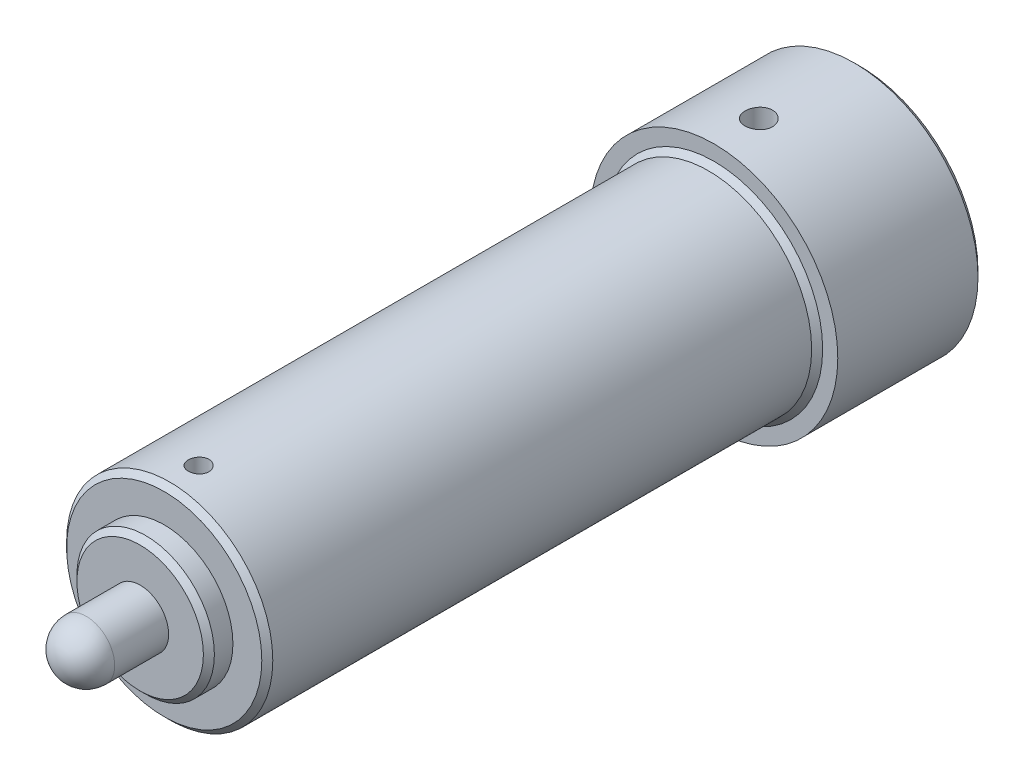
ISO-10303-21;
HEADER;
FILE_DESCRIPTION(('STEP AP214'),'2;1');
FILE_NAME('part.step','',(''),(''),'','','');
FILE_SCHEMA(('AUTOMOTIVE_DESIGN { 1 0 10303 214 1 1 1 1 }'));
ENDSEC;
DATA;
#1=APPLICATION_CONTEXT('core data for automotive mechanical design processes');
#2=APPLICATION_PROTOCOL_DEFINITION('international standard','automotive_design',2000,#1);
#3=PRODUCT_CONTEXT('',#1,'mechanical');
#4=PRODUCT('Part','Part','',(#3));
#5=PRODUCT_RELATED_PRODUCT_CATEGORY('part','',(#4));
#6=PRODUCT_DEFINITION_FORMATION('','',#4);
#7=PRODUCT_DEFINITION_CONTEXT('part definition',#1,'design');
#8=PRODUCT_DEFINITION('design','',#6,#7);
#9=PRODUCT_DEFINITION_SHAPE('','',#8);
#10=(LENGTH_UNIT() NAMED_UNIT(*) SI_UNIT(.MILLI.,.METRE.));
#11=(NAMED_UNIT(*) PLANE_ANGLE_UNIT() SI_UNIT($,.RADIAN.));
#12=(NAMED_UNIT(*) SI_UNIT($,.STERADIAN.) SOLID_ANGLE_UNIT());
#13=UNCERTAINTY_MEASURE_WITH_UNIT(LENGTH_MEASURE(1.E-05),#10,'distance_accuracy_value','');
#14=(GEOMETRIC_REPRESENTATION_CONTEXT(3) GLOBAL_UNCERTAINTY_ASSIGNED_CONTEXT((#13)) GLOBAL_UNIT_ASSIGNED_CONTEXT((#10,
#11,#12)) REPRESENTATION_CONTEXT('',''));
#15=CARTESIAN_POINT('',(0.,0.,0.));
#16=DIRECTION('',(0.,0.,1.));
#17=DIRECTION('',(1.,0.,0.));
#18=AXIS2_PLACEMENT_3D('',#15,#16,#17);
#19=CARTESIAN_POINT('',(0.,0.,21.2));
#20=DIRECTION('',(0.,0.,-1.));
#21=DIRECTION('',(-1.,0.,0.));
#22=AXIS2_PLACEMENT_3D('',#19,#20,#21);
#23=CYLINDRICAL_SURFACE('',#22,18.);
#24=CARTESIAN_POINT('',(0.,-18.,16.7));
#25=CARTESIAN_POINT('',(0.111970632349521,-17.9999985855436,16.6999951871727));
#26=CARTESIAN_POINT('',(0.224013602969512,-17.9989441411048,16.6905652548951));
#27=CARTESIAN_POINT('',(0.444988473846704,-17.9948391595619,16.6530924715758));
#28=CARTESIAN_POINT('',(0.553916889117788,-17.9917864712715,16.6250295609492));
#29=CARTESIAN_POINT('',(0.765431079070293,-17.9840293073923,16.5511220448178));
#30=CARTESIAN_POINT('',(0.868020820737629,-17.9793258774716,16.5052886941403));
#31=CARTESIAN_POINT('',(1.06403053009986,-17.9687919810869,16.3971643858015));
#32=CARTESIAN_POINT('',(1.1574522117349,-17.9629617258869,16.3348765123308));
#33=CARTESIAN_POINT('',(1.33290575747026,-17.9507977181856,16.1953179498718));
#34=CARTESIAN_POINT('',(1.4148915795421,-17.9444620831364,16.1179895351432));
#35=CARTESIAN_POINT('',(1.56475003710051,-17.9320167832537,15.9506685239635));
#36=CARTESIAN_POINT('',(1.63262199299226,-17.9259071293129,15.8606753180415));
#37=CARTESIAN_POINT('',(1.7524930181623,-17.9145866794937,15.6702860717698));
#38=CARTESIAN_POINT('',(1.80444975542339,-17.9093782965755,15.5698632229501));
#39=CARTESIAN_POINT('',(1.89074517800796,-17.9004741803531,15.3616505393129));
#40=CARTESIAN_POINT('',(1.92508439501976,-17.8967784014,15.253860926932));
#41=CARTESIAN_POINT('',(1.97503194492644,-17.8913354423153,15.0344480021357));
#42=CARTESIAN_POINT('',(1.99071729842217,-17.8895802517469,14.9228424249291));
#43=CARTESIAN_POINT('',(2.00315006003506,-17.8881925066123,14.6985701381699));
#44=CARTESIAN_POINT('',(1.99989807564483,-17.8885598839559,14.5859034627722));
#45=CARTESIAN_POINT('',(1.97461184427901,-17.891368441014,14.3632405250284));
#46=CARTESIAN_POINT('',(1.95266200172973,-17.8938003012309,14.2532345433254));
#47=CARTESIAN_POINT('',(1.89073461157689,-17.9004492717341,14.0384773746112));
#48=CARTESIAN_POINT('',(1.85075676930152,-17.904666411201,13.9337262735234));
#49=CARTESIAN_POINT('',(1.75381606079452,-17.9144214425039,13.7321875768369));
#50=CARTESIAN_POINT('',(1.6968160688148,-17.9199622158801,13.6354179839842));
#51=CARTESIAN_POINT('',(1.56747570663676,-17.9317378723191,13.4527863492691));
#52=CARTESIAN_POINT('',(1.49513478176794,-17.9379727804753,13.3669247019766));
#53=CARTESIAN_POINT('',(1.33669614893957,-17.9504756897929,13.2080560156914));
#54=CARTESIAN_POINT('',(1.25052560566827,-17.9567436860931,13.1351215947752));
#55=CARTESIAN_POINT('',(1.06712581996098,-17.9685745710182,13.0047416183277));
#56=CARTESIAN_POINT('',(0.969896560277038,-17.9741374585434,12.9472960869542));
#57=CARTESIAN_POINT('',(0.767086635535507,-17.9839338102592,12.8495262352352));
#58=CARTESIAN_POINT('',(0.661504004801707,-17.9881669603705,12.8092059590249));
#59=CARTESIAN_POINT('',(0.445009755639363,-17.9948238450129,12.7468862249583));
#60=CARTESIAN_POINT('',(0.33409833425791,-17.997247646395,12.7248860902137));
#61=CARTESIAN_POINT('',(0.110723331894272,-18.0000041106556,12.6999240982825));
#62=CARTESIAN_POINT('',(-0.00172892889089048,-18.0003477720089,12.6968621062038));
#63=CARTESIAN_POINT('',(-0.225544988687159,-17.998934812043,12.7095997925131));
#64=CARTESIAN_POINT('',(-0.336908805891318,-17.9971782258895,12.7253991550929));
#65=CARTESIAN_POINT('',(-0.555095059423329,-17.9917690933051,12.7753279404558));
#66=CARTESIAN_POINT('',(-0.661928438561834,-17.9881214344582,12.8094101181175));
#67=CARTESIAN_POINT('',(-0.868362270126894,-17.9793390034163,12.8948882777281));
#68=CARTESIAN_POINT('',(-0.967962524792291,-17.9742041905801,12.946284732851));
#69=CARTESIAN_POINT('',(-1.15755326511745,-17.9629935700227,13.065178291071));
#70=CARTESIAN_POINT('',(-1.24750253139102,-17.9569139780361,13.1327407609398));
#71=CARTESIAN_POINT('',(-1.41481983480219,-17.9445071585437,13.2819552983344));
#72=CARTESIAN_POINT('',(-1.49218748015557,-17.938179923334,13.3636078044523));
#73=CARTESIAN_POINT('',(-1.63249622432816,-17.925957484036,13.539123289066));
#74=CARTESIAN_POINT('',(-1.69537132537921,-17.920064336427,13.6330391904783));
#75=CARTESIAN_POINT('',(-1.80445556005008,-17.9094097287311,13.8301562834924));
#76=CARTESIAN_POINT('',(-1.85066496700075,-17.9046482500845,13.9333573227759));
#77=CARTESIAN_POINT('',(-1.92499712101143,-17.8968094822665,14.1458944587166));
#78=CARTESIAN_POINT('',(-1.95315827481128,-17.8937286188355,14.2552169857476));
#79=CARTESIAN_POINT('',(-1.99071877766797,-17.8895891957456,14.4770751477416));
#80=CARTESIAN_POINT('',(-2.00011880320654,-17.8885305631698,14.5896106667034));
#81=CARTESIAN_POINT('',(-1.99987957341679,-17.8885572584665,14.814044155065));
#82=CARTESIAN_POINT('',(-1.99034399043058,-17.8896309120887,14.9259422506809));
#83=CARTESIAN_POINT('',(-1.9527225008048,-17.8937762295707,15.1465357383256));
#84=CARTESIAN_POINT('',(-1.92463658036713,-17.8968478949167,15.2552311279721));
#85=CARTESIAN_POINT('',(-1.85074191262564,-17.9046397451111,15.4663275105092));
#86=CARTESIAN_POINT('',(-1.80493703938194,-17.9093595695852,15.5687298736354));
#87=CARTESIAN_POINT('',(-1.69691508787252,-17.9199166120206,15.7644104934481));
#88=CARTESIAN_POINT('',(-1.63469797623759,-17.9257538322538,15.857688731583));
#89=CARTESIAN_POINT('',(-1.49522995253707,-17.9379262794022,16.0330042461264));
#90=CARTESIAN_POINT('',(-1.41790170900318,-17.944263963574,16.1149798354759));
#91=CARTESIAN_POINT('',(-1.25056419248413,-17.9567010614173,16.2648338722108));
#92=CARTESIAN_POINT('',(-1.16055190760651,-17.962800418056,16.3327089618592));
#93=CARTESIAN_POINT('',(-0.970094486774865,-17.9740935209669,16.4526043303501));
#94=CARTESIAN_POINT('',(-0.869618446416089,-17.9792844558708,16.5045757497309));
#95=CARTESIAN_POINT('',(-0.661368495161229,-17.9881463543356,16.5908374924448));
#96=CARTESIAN_POINT('',(-0.553602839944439,-17.9918190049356,16.6251474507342));
#97=CARTESIAN_POINT('',(-0.371040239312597,-17.9963232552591,16.6666991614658));
#98=CARTESIAN_POINT('',(-0.297404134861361,-17.9976954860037,16.6791695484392));
#99=CARTESIAN_POINT('',(-0.149189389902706,-17.9995343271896,16.695821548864));
#100=CARTESIAN_POINT('',(-0.0746107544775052,-18.000000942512,16.7000032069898));
#101=CARTESIAN_POINT('',(0.,-18.,16.7));
#102=B_SPLINE_CURVE_WITH_KNOTS('',3,(#24,#25,#26,#27,#28,#29,#30,#31,#32,#33,#34,#35,#36,#37,
#38,#39,#40,#41,#42,#43,#44,#45,#46,#47,#48,#49,#50,#51,#52,#53,#54,#55,#56,#57,#58,#59,#60,#61,
#62,#63,#64,#65,#66,#67,#68,#69,#70,#71,#72,#73,#74,#75,#76,#77,#78,#79,#80,#81,#82,#83,#84,#85,
#86,#87,#88,#89,#90,#91,#92,#93,#94,#95,#96,#97,#98,#99,#100,#101),.UNSPECIFIED.,.T.,.F.,(4,2,2,
2,2,2,2,2,2,2,2,2,2,2,2,2,2,2,2,2,2,2,2,2,2,2,2,2,2,2,2,2,2,2,2,2,2,2,4),(0.,0.335639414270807,
0.671640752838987,1.00742963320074,1.34315561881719,1.68019649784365,2.01725360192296,
2.35519959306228,2.69313538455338,3.02967096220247,3.36619574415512,3.70120941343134,
4.03622855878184,4.37198379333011,4.70775116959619,5.0453487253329,5.3829468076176,
5.72062456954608,6.05828985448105,6.39416820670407,6.73004093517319,7.06504987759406,
7.40006797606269,7.73646430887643,8.07287111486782,8.41078088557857,8.74868511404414,
9.08586787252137,9.42303847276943,9.75836815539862,10.0936980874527,10.4289547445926,
10.7642120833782,11.1012322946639,11.4383326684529,11.7764585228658,12.1142076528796,
12.3378595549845,12.5615102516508),.UNSPECIFIED.);
#103=CARTESIAN_POINT('',(0.,-18.,16.7));
#104=VERTEX_POINT('',#103);
#105=EDGE_CURVE('E10',#104,#104,#102,.T.);
#106=ORIENTED_EDGE('',*,*,#105,.T.);
#107=EDGE_LOOP('',(#106));
#108=FACE_BOUND('',#107,.T.);
#109=CARTESIAN_POINT('',(0.,18.,16.7));
#110=CARTESIAN_POINT('',(-0.111970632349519,17.9999985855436,16.6999951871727));
#111=CARTESIAN_POINT('',(-0.22401360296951,17.9989441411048,16.6905652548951));
#112=CARTESIAN_POINT('',(-0.444988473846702,17.9948391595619,16.6530924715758));
#113=CARTESIAN_POINT('',(-0.553916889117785,17.9917864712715,16.6250295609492));
#114=CARTESIAN_POINT('',(-0.765431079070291,17.9840293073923,16.5511220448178));
#115=CARTESIAN_POINT('',(-0.868020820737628,17.9793258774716,16.5052886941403));
#116=CARTESIAN_POINT('',(-1.06403053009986,17.9687919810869,16.3971643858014));
#117=CARTESIAN_POINT('',(-1.15745221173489,17.9629617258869,16.3348765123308));
#118=CARTESIAN_POINT('',(-1.33290575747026,17.9507977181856,16.1953179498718));
#119=CARTESIAN_POINT('',(-1.4148915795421,17.9444620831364,16.1179895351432));
#120=CARTESIAN_POINT('',(-1.56475003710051,17.9320167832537,15.9506685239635));
#121=CARTESIAN_POINT('',(-1.63262199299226,17.9259071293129,15.8606753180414));
#122=CARTESIAN_POINT('',(-1.7524930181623,17.9145866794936,15.6702860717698));
#123=CARTESIAN_POINT('',(-1.80444975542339,17.9093782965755,15.5698632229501));
#124=CARTESIAN_POINT('',(-1.89074517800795,17.9004741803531,15.3616505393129));
#125=CARTESIAN_POINT('',(-1.92508439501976,17.8967784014,15.253860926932));
#126=CARTESIAN_POINT('',(-1.97503194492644,17.8913354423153,15.0344480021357));
#127=CARTESIAN_POINT('',(-1.99071729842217,17.8895802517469,14.9228424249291));
#128=CARTESIAN_POINT('',(-2.00315006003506,17.8881925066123,14.6985701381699));
#129=CARTESIAN_POINT('',(-1.99989807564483,17.8885598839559,14.5859034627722));
#130=CARTESIAN_POINT('',(-1.97461184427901,17.891368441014,14.3632405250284));
#131=CARTESIAN_POINT('',(-1.95266200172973,17.8938003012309,14.2532345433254));
#132=CARTESIAN_POINT('',(-1.89073461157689,17.9004492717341,14.0384773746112));
#133=CARTESIAN_POINT('',(-1.85075676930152,17.904666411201,13.9337262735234));
#134=CARTESIAN_POINT('',(-1.75381606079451,17.9144214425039,13.7321875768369));
#135=CARTESIAN_POINT('',(-1.6968160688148,17.9199622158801,13.6354179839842));
#136=CARTESIAN_POINT('',(-1.56747570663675,17.9317378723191,13.4527863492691));
#137=CARTESIAN_POINT('',(-1.49513478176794,17.9379727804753,13.3669247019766));
#138=CARTESIAN_POINT('',(-1.33669614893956,17.9504756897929,13.2080560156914));
#139=CARTESIAN_POINT('',(-1.25052560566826,17.9567436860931,13.1351215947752));
#140=CARTESIAN_POINT('',(-1.06712581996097,17.9685745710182,13.0047416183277));
#141=CARTESIAN_POINT('',(-0.969896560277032,17.9741374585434,12.9472960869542));
#142=CARTESIAN_POINT('',(-0.767086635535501,17.9839338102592,12.8495262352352));
#143=CARTESIAN_POINT('',(-0.661504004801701,17.9881669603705,12.8092059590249));
#144=CARTESIAN_POINT('',(-0.445009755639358,17.9948238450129,12.7468862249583));
#145=CARTESIAN_POINT('',(-0.334098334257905,17.997247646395,12.7248860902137));
#146=CARTESIAN_POINT('',(-0.110723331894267,18.0000041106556,12.6999240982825));
#147=CARTESIAN_POINT('',(0.00172892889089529,18.0003477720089,12.6968621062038));
#148=CARTESIAN_POINT('',(0.225544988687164,17.998934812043,12.7095997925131));
#149=CARTESIAN_POINT('',(0.336908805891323,17.9971782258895,12.7253991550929));
#150=CARTESIAN_POINT('',(0.555095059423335,17.9917690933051,12.7753279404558));
#151=CARTESIAN_POINT('',(0.661928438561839,17.9881214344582,12.8094101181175));
#152=CARTESIAN_POINT('',(0.868362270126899,17.9793390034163,12.8948882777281));
#153=CARTESIAN_POINT('',(0.967962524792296,17.9742041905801,12.946284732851));
#154=CARTESIAN_POINT('',(1.15755326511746,17.9629935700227,13.065178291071));
#155=CARTESIAN_POINT('',(1.24750253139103,17.9569139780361,13.1327407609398));
#156=CARTESIAN_POINT('',(1.4148198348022,17.9445071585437,13.2819552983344));
#157=CARTESIAN_POINT('',(1.49218748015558,17.938179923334,13.3636078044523));
#158=CARTESIAN_POINT('',(1.63249622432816,17.925957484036,13.539123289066));
#159=CARTESIAN_POINT('',(1.69537132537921,17.920064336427,13.6330391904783));
#160=CARTESIAN_POINT('',(1.80445556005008,17.9094097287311,13.8301562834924));
#161=CARTESIAN_POINT('',(1.85066496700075,17.9046482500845,13.9333573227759));
#162=CARTESIAN_POINT('',(1.92499712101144,17.8968094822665,14.1458944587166));
#163=CARTESIAN_POINT('',(1.95315827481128,17.8937286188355,14.2552169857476));
#164=CARTESIAN_POINT('',(1.99071877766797,17.8895891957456,14.4770751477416));
#165=CARTESIAN_POINT('',(2.00011880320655,17.8885305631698,14.5896106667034));
#166=CARTESIAN_POINT('',(1.99987957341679,17.8885572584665,14.814044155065));
#167=CARTESIAN_POINT('',(1.99034399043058,17.8896309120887,14.9259422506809));
#168=CARTESIAN_POINT('',(1.9527225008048,17.8937762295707,15.1465357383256));
#169=CARTESIAN_POINT('',(1.92463658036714,17.8968478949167,15.2552311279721));
#170=CARTESIAN_POINT('',(1.85074191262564,17.9046397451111,15.4663275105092));
#171=CARTESIAN_POINT('',(1.80493703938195,17.9093595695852,15.5687298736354));
#172=CARTESIAN_POINT('',(1.69691508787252,17.9199166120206,15.7644104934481));
#173=CARTESIAN_POINT('',(1.6346979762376,17.9257538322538,15.857688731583));
#174=CARTESIAN_POINT('',(1.49522995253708,17.9379262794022,16.0330042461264));
#175=CARTESIAN_POINT('',(1.41790170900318,17.944263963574,16.1149798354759));
#176=CARTESIAN_POINT('',(1.25056419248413,17.9567010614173,16.2648338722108));
#177=CARTESIAN_POINT('',(1.16055190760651,17.962800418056,16.3327089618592));
#178=CARTESIAN_POINT('',(0.970094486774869,17.9740935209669,16.4526043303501));
#179=CARTESIAN_POINT('',(0.869618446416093,17.9792844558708,16.5045757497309));
#180=CARTESIAN_POINT('',(0.661368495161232,17.9881463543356,16.5908374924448));
#181=CARTESIAN_POINT('',(0.553602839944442,17.9918190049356,16.6251474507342));
#182=CARTESIAN_POINT('',(0.371040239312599,17.9963232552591,16.6666991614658));
#183=CARTESIAN_POINT('',(0.297404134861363,17.9976954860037,16.6791695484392));
#184=CARTESIAN_POINT('',(0.149189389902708,17.9995343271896,16.695821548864));
#185=CARTESIAN_POINT('',(0.0746107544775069,18.000000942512,16.7000032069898));
#186=CARTESIAN_POINT('',(0.,18.,16.7));
#187=B_SPLINE_CURVE_WITH_KNOTS('',3,(#109,#110,#111,#112,#113,#114,#115,#116,#117,#118,#119,
#120,#121,#122,#123,#124,#125,#126,#127,#128,#129,#130,#131,#132,#133,#134,#135,#136,#137,#138,
#139,#140,#141,#142,#143,#144,#145,#146,#147,#148,#149,#150,#151,#152,#153,#154,#155,#156,#157,
#158,#159,#160,#161,#162,#163,#164,#165,#166,#167,#168,#169,#170,#171,#172,#173,#174,#175,#176,
#177,#178,#179,#180,#181,#182,#183,#184,#185,#186),.UNSPECIFIED.,.T.,.F.,(4,2,2,2,2,2,2,2,2,2,2,
2,2,2,2,2,2,2,2,2,2,2,2,2,2,2,2,2,2,2,2,2,2,2,2,2,2,2,4),(0.,0.335639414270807,
0.671640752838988,1.00742963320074,1.34315561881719,1.68019649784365,2.01725360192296,
2.35519959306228,2.69313538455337,3.02967096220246,3.36619574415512,3.70120941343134,
4.03622855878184,4.37198379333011,4.70775116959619,5.0453487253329,5.3829468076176,
5.72062456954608,6.05828985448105,6.39416820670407,6.73004093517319,7.06504987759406,
7.40006797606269,7.73646430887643,8.07287111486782,8.41078088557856,8.74868511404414,
9.08586787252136,9.42303847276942,9.75836815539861,10.0936980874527,10.4289547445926,
10.7642120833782,11.1012322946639,11.4383326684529,11.7764585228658,12.1142076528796,
12.3378595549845,12.5615102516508),.UNSPECIFIED.);
#188=CARTESIAN_POINT('',(0.,18.,16.7));
#189=VERTEX_POINT('',#188);
#190=EDGE_CURVE('E55',#189,#189,#187,.T.);
#191=ORIENTED_EDGE('',*,*,#190,.T.);
#192=EDGE_LOOP('',(#191));
#193=FACE_BOUND('',#192,.T.);
#194=CARTESIAN_POINT('',(0.,0.,0.799999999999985));
#195=DIRECTION('',(0.,0.,1.));
#196=DIRECTION('',(1.,0.,0.));
#197=AXIS2_PLACEMENT_3D('',#194,#195,#196);
#198=CIRCLE('',#197,18.);
#199=CARTESIAN_POINT('',(18.,0.,0.799999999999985));
#200=VERTEX_POINT('',#199);
#201=EDGE_CURVE('E135',#200,#200,#198,.T.);
#202=ORIENTED_EDGE('',*,*,#201,.T.);
#203=EDGE_LOOP('',(#202));
#204=FACE_BOUND('',#203,.T.);
#205=CARTESIAN_POINT('',(0.,0.,21.2));
#206=DIRECTION('',(0.,0.,1.));
#207=DIRECTION('',(1.,0.,0.));
#208=AXIS2_PLACEMENT_3D('',#205,#206,#207);
#209=CIRCLE('',#208,18.);
#210=CARTESIAN_POINT('',(18.,0.,21.2));
#211=VERTEX_POINT('',#210);
#212=EDGE_CURVE('E104',#211,#211,#209,.T.);
#213=ORIENTED_EDGE('',*,*,#212,.F.);
#214=EDGE_LOOP('',(#213));
#215=FACE_BOUND('',#214,.T.);
#216=ADVANCED_FACE('F45',(#108,#193,#204,#215),#23,.T.);
#217=CARTESIAN_POINT('',(0.,0.,21.2));
#218=DIRECTION('',(0.,0.,1.));
#219=DIRECTION('',(1.,0.,0.));
#220=AXIS2_PLACEMENT_3D('',#217,#218,#219);
#221=PLANE('',#220);
#222=CARTESIAN_POINT('',(0.,0.,21.2));
#223=DIRECTION('',(0.,0.,1.));
#224=DIRECTION('',(1.,0.,0.));
#225=AXIS2_PLACEMENT_3D('',#222,#223,#224);
#226=CIRCLE('',#225,15.8);
#227=CARTESIAN_POINT('',(15.8,0.,21.2));
#228=VERTEX_POINT('',#227);
#229=EDGE_CURVE('E166',#228,#228,#226,.F.);
#230=ORIENTED_EDGE('',*,*,#229,.T.);
#231=EDGE_LOOP('',(#230));
#232=FACE_BOUND('',#231,.T.);
#233=ORIENTED_EDGE('',*,*,#212,.T.);
#234=EDGE_LOOP('',(#233));
#235=FACE_BOUND('',#234,.T.);
#236=ADVANCED_FACE('F114',(#232,#235),#221,.T.);
#237=CARTESIAN_POINT('',(0.,0.,0.));
#238=DIRECTION('',(0.,0.,1.));
#239=DIRECTION('',(1.,0.,0.));
#240=AXIS2_PLACEMENT_3D('',#237,#238,#239);
#241=PLANE('',#240);
#242=CARTESIAN_POINT('',(0.,0.,0.));
#243=DIRECTION('',(0.,0.,1.));
#244=DIRECTION('',(1.,0.,0.));
#245=AXIS2_PLACEMENT_3D('',#242,#243,#244);
#246=CIRCLE('',#245,15.5);
#247=CARTESIAN_POINT('',(15.5,0.,0.));
#248=VERTEX_POINT('',#247);
#249=EDGE_CURVE('E50',#248,#248,#246,.F.);
#250=ORIENTED_EDGE('',*,*,#249,.F.);
#251=EDGE_LOOP('',(#250));
#252=FACE_BOUND('',#251,.T.);
#253=CARTESIAN_POINT('',(0.,0.,0.));
#254=DIRECTION('',(0.,0.,1.));
#255=DIRECTION('',(1.,0.,0.));
#256=AXIS2_PLACEMENT_3D('',#253,#254,#255);
#257=CIRCLE('',#256,17.2);
#258=CARTESIAN_POINT('',(17.2,0.,0.));
#259=VERTEX_POINT('',#258);
#260=EDGE_CURVE('E154',#259,#259,#257,.F.);
#261=ORIENTED_EDGE('',*,*,#260,.T.);
#262=EDGE_LOOP('',(#261));
#263=FACE_BOUND('',#262,.T.);
#264=ADVANCED_FACE('F111',(#252,#263),#241,.F.);
#265=CARTESIAN_POINT('',(0.,0.,101.2));
#266=DIRECTION('',(0.,0.,-1.));
#267=DIRECTION('',(-1.,0.,0.));
#268=AXIS2_PLACEMENT_3D('',#265,#266,#267);
#269=CYLINDRICAL_SURFACE('',#268,15.);
#270=CARTESIAN_POINT('',(0.,-15.,97.7));
#271=CARTESIAN_POINT('',(0.084030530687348,-14.9999990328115,97.6999963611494));
#272=CARTESIAN_POINT('',(0.168116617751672,-14.9992863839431,97.6929150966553));
#273=CARTESIAN_POINT('',(0.333957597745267,-14.9965120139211,97.6647734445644));
#274=CARTESIAN_POINT('',(0.415709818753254,-14.9944488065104,97.6436976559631));
#275=CARTESIAN_POINT('',(0.574457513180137,-14.9892062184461,97.5881866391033));
#276=CARTESIAN_POINT('',(0.651455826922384,-14.9860275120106,97.5537594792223));
#277=CARTESIAN_POINT('',(0.79856424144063,-14.9789093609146,97.4725386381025));
#278=CARTESIAN_POINT('',(0.868675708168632,-14.974970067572,97.4257474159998));
#279=CARTESIAN_POINT('',(1.00028932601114,-14.9667561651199,97.3209459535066));
#280=CARTESIAN_POINT('',(1.06176321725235,-14.962480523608,97.2629003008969));
#281=CARTESIAN_POINT('',(1.17411378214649,-14.9540843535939,97.1373131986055));
#282=CARTESIAN_POINT('',(1.22498996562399,-14.9499638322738,97.0697713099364));
#283=CARTESIAN_POINT('',(1.31480095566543,-14.9423338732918,96.9269322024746));
#284=CARTESIAN_POINT('',(1.35371019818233,-14.9388257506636,96.8516188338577));
#285=CARTESIAN_POINT('',(1.41831957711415,-14.9328305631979,96.6954866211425));
#286=CARTESIAN_POINT('',(1.44402003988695,-14.9303434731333,96.6146679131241));
#287=CARTESIAN_POINT('',(1.48139856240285,-14.9266812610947,96.450107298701));
#288=CARTESIAN_POINT('',(1.49312347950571,-14.9255017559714,96.3663761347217));
#289=CARTESIAN_POINT('',(1.50236292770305,-14.9245746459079,96.1981267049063));
#290=CARTESIAN_POINT('',(1.49987783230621,-14.9248270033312,96.1136084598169));
#291=CARTESIAN_POINT('',(1.48080642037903,-14.926731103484,95.94650703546));
#292=CARTESIAN_POINT('',(1.46427126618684,-14.9283777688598,95.8639179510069));
#293=CARTESIAN_POINT('',(1.41764871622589,-14.9328770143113,95.7026930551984));
#294=CARTESIAN_POINT('',(1.38756113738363,-14.9357296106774,95.6240572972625));
#295=CARTESIAN_POINT('',(1.31463134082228,-14.942325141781,95.4728096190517));
#296=CARTESIAN_POINT('',(1.27176642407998,-14.9460696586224,95.400208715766));
#297=CARTESIAN_POINT('',(1.17451504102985,-14.9540257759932,95.2632121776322));
#298=CARTESIAN_POINT('',(1.12012823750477,-14.9582373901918,95.1988167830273));
#299=CARTESIAN_POINT('',(1.00109116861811,-14.9666757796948,95.0797619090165));
#300=CARTESIAN_POINT('',(0.936396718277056,-14.970902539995,95.0251465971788));
#301=CARTESIAN_POINT('',(0.798734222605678,-14.9788774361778,94.9275445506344));
#302=CARTESIAN_POINT('',(0.725766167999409,-14.9826255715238,94.8845578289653));
#303=CARTESIAN_POINT('',(0.573597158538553,-14.9892221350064,94.8114349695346));
#304=CARTESIAN_POINT('',(0.494395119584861,-14.9920704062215,94.7813010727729));
#305=CARTESIAN_POINT('',(0.332020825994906,-14.9965447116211,94.7347716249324));
#306=CARTESIAN_POINT('',(0.24884869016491,-14.9981707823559,94.7183756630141));
#307=CARTESIAN_POINT('',(0.081277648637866,-15.0000127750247,94.6998435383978));
#308=CARTESIAN_POINT('',(-0.00311445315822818,-15.000234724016,94.6976464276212));
#309=CARTESIAN_POINT('',(-0.17106568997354,-14.999259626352,94.7074142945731));
#310=CARTESIAN_POINT('',(-0.254624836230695,-14.998062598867,94.7193790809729));
#311=CARTESIAN_POINT('',(-0.418362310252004,-14.9943879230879,94.7570805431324));
#312=CARTESIAN_POINT('',(-0.498547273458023,-14.9919129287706,94.782788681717));
#313=CARTESIAN_POINT('',(-0.653466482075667,-14.9859599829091,94.8472177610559));
#314=CARTESIAN_POINT('',(-0.728200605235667,-14.9824820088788,94.8859389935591));
#315=CARTESIAN_POINT('',(-0.870372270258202,-14.9748971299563,94.9754462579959));
#316=CARTESIAN_POINT('',(-0.937784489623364,-14.9707881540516,95.0262723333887));
#317=CARTESIAN_POINT('',(-1.06314243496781,-14.9624089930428,95.1384891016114));
#318=CARTESIAN_POINT('',(-1.12108792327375,-14.9581388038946,95.1998800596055));
#319=CARTESIAN_POINT('',(-1.22607916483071,-14.9499003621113,95.3317498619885));
#320=CARTESIAN_POINT('',(-1.27308491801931,-14.9459332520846,95.4022606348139));
#321=CARTESIAN_POINT('',(-1.35458738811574,-14.9387674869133,95.55021104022));
#322=CARTESIAN_POINT('',(-1.38908427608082,-14.9355688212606,95.6276505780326));
#323=CARTESIAN_POINT('',(-1.4445228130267,-14.9303092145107,95.7871231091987));
#324=CARTESIAN_POINT('',(-1.46548826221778,-14.9282462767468,95.8691477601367));
#325=CARTESIAN_POINT('',(-1.49334601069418,-14.9254854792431,96.0355747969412));
#326=CARTESIAN_POINT('',(-1.50023871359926,-14.9247875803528,96.1199771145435));
#327=CARTESIAN_POINT('',(-1.49974970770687,-14.9248366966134,96.288366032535));
#328=CARTESIAN_POINT('',(-1.49243083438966,-14.9255773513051,96.3723528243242));
#329=CARTESIAN_POINT('',(-1.46385817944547,-14.9284065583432,96.5378973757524));
#330=CARTESIAN_POINT('',(-1.44260438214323,-14.9304951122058,96.619455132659));
#331=CARTESIAN_POINT('',(-1.38678252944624,-14.9357830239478,96.7778260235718));
#332=CARTESIAN_POINT('',(-1.35221631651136,-14.9389822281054,96.8546398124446));
#333=CARTESIAN_POINT('',(-1.27075733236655,-14.9461312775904,97.0013853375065));
#334=CARTESIAN_POINT('',(-1.22386463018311,-14.9500811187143,97.0713171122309));
#335=CARTESIAN_POINT('',(-1.11884783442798,-14.9583073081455,97.2026355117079));
#336=CARTESIAN_POINT('',(-1.06067692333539,-14.9625849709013,97.2639846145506));
#337=CARTESIAN_POINT('',(-0.934847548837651,-14.9709728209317,97.3760783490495));
#338=CARTESIAN_POINT('',(-0.867186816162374,-14.9750829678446,97.4268204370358));
#339=CARTESIAN_POINT('',(-0.724112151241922,-14.9826834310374,97.5163601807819));
#340=CARTESIAN_POINT('',(-0.648679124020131,-14.9861721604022,97.5551274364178));
#341=CARTESIAN_POINT('',(-0.492387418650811,-14.9921194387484,97.6193936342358));
#342=CARTESIAN_POINT('',(-0.411534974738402,-14.9945791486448,97.6449075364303));
#343=CARTESIAN_POINT('',(-0.275187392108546,-14.997573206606,97.6755809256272));
#344=CARTESIAN_POINT('',(-0.220563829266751,-14.9984790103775,97.684725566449));
#345=CARTESIAN_POINT('',(-0.110634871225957,-14.9996927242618,97.6969362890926));
#346=CARTESIAN_POINT('',(-0.0553294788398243,-15.0000006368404,97.7000023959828));
#347=CARTESIAN_POINT('',(0.,-15.,97.7));
#348=B_SPLINE_CURVE_WITH_KNOTS('',3,(#270,#271,#272,#273,#274,#275,#276,#277,#278,#279,#280,
#281,#282,#283,#284,#285,#286,#287,#288,#289,#290,#291,#292,#293,#294,#295,#296,#297,#298,#299,
#300,#301,#302,#303,#304,#305,#306,#307,#308,#309,#310,#311,#312,#313,#314,#315,#316,#317,#318,
#319,#320,#321,#322,#323,#324,#325,#326,#327,#328,#329,#330,#331,#332,#333,#334,#335,#336,#337,
#338,#339,#340,#341,#342,#343,#344,#345,#346,#347),.UNSPECIFIED.,.T.,.F.,(4,2,2,2,2,2,2,2,2,2,2,
2,2,2,2,2,2,2,2,2,2,2,2,2,2,2,2,2,2,2,2,2,2,2,2,2,2,2,4),(0.,0.251889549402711,
0.504056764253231,0.756071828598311,1.00803680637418,1.26080785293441,1.51359058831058,
1.76690963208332,2.02022241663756,2.27268348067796,2.52513790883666,2.77667696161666,
3.0282194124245,3.28021142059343,3.53221080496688,3.78532101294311,4.03843150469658,
4.29158611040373,4.5447331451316,4.79679282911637,5.04884910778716,5.30038402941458,
5.55192459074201,5.80430911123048,6.05669996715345,6.30999965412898,6.56329587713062,
6.81614535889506,7.06898758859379,7.32071443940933,7.5724415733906,7.82413388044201,
8.07582477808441,8.3285837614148,8.58140328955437,8.83485946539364,9.08802892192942,
9.25388500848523,9.41974041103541),.UNSPECIFIED.);
#349=CARTESIAN_POINT('',(0.,-15.,97.7));
#350=VERTEX_POINT('',#349);
#351=EDGE_CURVE('E98',#350,#350,#348,.T.);
#352=ORIENTED_EDGE('',*,*,#351,.T.);
#353=EDGE_LOOP('',(#352));
#354=FACE_BOUND('',#353,.T.);
#355=CARTESIAN_POINT('',(0.,15.,97.7));
#356=CARTESIAN_POINT('',(-0.0840305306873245,14.9999990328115,97.6999963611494));
#357=CARTESIAN_POINT('',(-0.168116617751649,14.9992863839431,97.6929150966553));
#358=CARTESIAN_POINT('',(-0.333957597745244,14.9965120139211,97.6647734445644));
#359=CARTESIAN_POINT('',(-0.41570981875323,14.9944488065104,97.6436976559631));
#360=CARTESIAN_POINT('',(-0.574457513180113,14.9892062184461,97.5881866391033));
#361=CARTESIAN_POINT('',(-0.65145582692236,14.9860275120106,97.5537594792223));
#362=CARTESIAN_POINT('',(-0.798564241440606,14.9789093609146,97.4725386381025));
#363=CARTESIAN_POINT('',(-0.868675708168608,14.974970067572,97.4257474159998));
#364=CARTESIAN_POINT('',(-1.00028932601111,14.9667561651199,97.3209459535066));
#365=CARTESIAN_POINT('',(-1.06176321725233,14.962480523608,97.2629003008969));
#366=CARTESIAN_POINT('',(-1.17411378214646,14.9540843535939,97.1373131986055));
#367=CARTESIAN_POINT('',(-1.22498996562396,14.9499638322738,97.0697713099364));
#368=CARTESIAN_POINT('',(-1.31480095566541,14.9423338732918,96.9269322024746));
#369=CARTESIAN_POINT('',(-1.3537101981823,14.9388257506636,96.8516188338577));
#370=CARTESIAN_POINT('',(-1.41831957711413,14.9328305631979,96.6954866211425));
#371=CARTESIAN_POINT('',(-1.44402003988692,14.9303434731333,96.6146679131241));
#372=CARTESIAN_POINT('',(-1.48139856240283,14.9266812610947,96.450107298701));
#373=CARTESIAN_POINT('',(-1.49312347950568,14.9255017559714,96.3663761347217));
#374=CARTESIAN_POINT('',(-1.50236292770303,14.9245746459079,96.1981267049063));
#375=CARTESIAN_POINT('',(-1.49987783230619,14.9248270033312,96.1136084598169));
#376=CARTESIAN_POINT('',(-1.480806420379,14.926731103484,95.94650703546));
#377=CARTESIAN_POINT('',(-1.46427126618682,14.9283777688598,95.8639179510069));
#378=CARTESIAN_POINT('',(-1.41764871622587,14.9328770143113,95.7026930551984));
#379=CARTESIAN_POINT('',(-1.38756113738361,14.9357296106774,95.6240572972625));
#380=CARTESIAN_POINT('',(-1.31463134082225,14.9423251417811,95.4728096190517));
#381=CARTESIAN_POINT('',(-1.27176642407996,14.9460696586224,95.400208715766));
#382=CARTESIAN_POINT('',(-1.17451504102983,14.9540257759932,95.2632121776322));
#383=CARTESIAN_POINT('',(-1.12012823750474,14.9582373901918,95.1988167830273));
#384=CARTESIAN_POINT('',(-1.00109116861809,14.9666757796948,95.0797619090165));
#385=CARTESIAN_POINT('',(-0.936396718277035,14.970902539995,95.0251465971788));
#386=CARTESIAN_POINT('',(-0.798734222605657,14.9788774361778,94.9275445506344));
#387=CARTESIAN_POINT('',(-0.725766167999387,14.9826255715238,94.8845578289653));
#388=CARTESIAN_POINT('',(-0.57359715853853,14.9892221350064,94.8114349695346));
#389=CARTESIAN_POINT('',(-0.494395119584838,14.9920704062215,94.7813010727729));
#390=CARTESIAN_POINT('',(-0.332020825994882,14.9965447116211,94.7347716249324));
#391=CARTESIAN_POINT('',(-0.248848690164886,14.998170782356,94.7183756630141));
#392=CARTESIAN_POINT('',(-0.0812776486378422,15.0000127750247,94.6998435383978));
#393=CARTESIAN_POINT('',(0.00311445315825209,15.000234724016,94.6976464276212));
#394=CARTESIAN_POINT('',(0.171065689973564,14.999259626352,94.7074142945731));
#395=CARTESIAN_POINT('',(0.254624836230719,14.998062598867,94.7193790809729));
#396=CARTESIAN_POINT('',(0.418362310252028,14.9943879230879,94.7570805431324));
#397=CARTESIAN_POINT('',(0.498547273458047,14.9919129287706,94.782788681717));
#398=CARTESIAN_POINT('',(0.65346648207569,14.9859599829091,94.8472177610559));
#399=CARTESIAN_POINT('',(0.728200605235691,14.9824820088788,94.8859389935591));
#400=CARTESIAN_POINT('',(0.870372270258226,14.9748971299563,94.9754462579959));
#401=CARTESIAN_POINT('',(0.937784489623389,14.9707881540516,95.0262723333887));
#402=CARTESIAN_POINT('',(1.06314243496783,14.9624089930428,95.1384891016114));
#403=CARTESIAN_POINT('',(1.12108792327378,14.9581388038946,95.1998800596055));
#404=CARTESIAN_POINT('',(1.22607916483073,14.9499003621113,95.3317498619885));
#405=CARTESIAN_POINT('',(1.27308491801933,14.9459332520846,95.4022606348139));
#406=CARTESIAN_POINT('',(1.35458738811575,14.9387674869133,95.55021104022));
#407=CARTESIAN_POINT('',(1.38908427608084,14.9355688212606,95.6276505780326));
#408=CARTESIAN_POINT('',(1.44452281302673,14.9303092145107,95.7871231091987));
#409=CARTESIAN_POINT('',(1.46548826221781,14.9282462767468,95.8691477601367));
#410=CARTESIAN_POINT('',(1.49334601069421,14.9254854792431,96.0355747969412));
#411=CARTESIAN_POINT('',(1.50023871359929,14.9247875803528,96.1199771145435));
#412=CARTESIAN_POINT('',(1.4997497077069,14.9248366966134,96.288366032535));
#413=CARTESIAN_POINT('',(1.49243083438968,14.9255773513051,96.3723528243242));
#414=CARTESIAN_POINT('',(1.46385817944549,14.9284065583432,96.5378973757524));
#415=CARTESIAN_POINT('',(1.44260438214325,14.9304951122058,96.619455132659));
#416=CARTESIAN_POINT('',(1.38678252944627,14.9357830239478,96.7778260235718));
#417=CARTESIAN_POINT('',(1.35221631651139,14.9389822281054,96.8546398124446));
#418=CARTESIAN_POINT('',(1.27075733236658,14.9461312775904,97.0013853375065));
#419=CARTESIAN_POINT('',(1.22386463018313,14.9500811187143,97.0713171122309));
#420=CARTESIAN_POINT('',(1.11884783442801,14.9583073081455,97.2026355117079));
#421=CARTESIAN_POINT('',(1.06067692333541,14.9625849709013,97.2639846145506));
#422=CARTESIAN_POINT('',(0.934847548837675,14.9709728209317,97.3760783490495));
#423=CARTESIAN_POINT('',(0.867186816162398,14.9750829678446,97.4268204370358));
#424=CARTESIAN_POINT('',(0.724112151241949,14.9826834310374,97.5163601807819));
#425=CARTESIAN_POINT('',(0.648679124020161,14.9861721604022,97.5551274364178));
#426=CARTESIAN_POINT('',(0.492387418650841,14.9921194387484,97.6193936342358));
#427=CARTESIAN_POINT('',(0.411534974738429,14.9945791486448,97.6449075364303));
#428=CARTESIAN_POINT('',(0.27518739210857,14.997573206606,97.6755809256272));
#429=CARTESIAN_POINT('',(0.220563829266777,14.9984790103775,97.684725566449));
#430=CARTESIAN_POINT('',(0.110634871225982,14.9996927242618,97.6969362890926));
#431=CARTESIAN_POINT('',(0.0553294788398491,15.0000006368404,97.7000023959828));
#432=CARTESIAN_POINT('',(0.,15.,97.7));
#433=B_SPLINE_CURVE_WITH_KNOTS('',3,(#355,#356,#357,#358,#359,#360,#361,#362,#363,#364,#365,
#366,#367,#368,#369,#370,#371,#372,#373,#374,#375,#376,#377,#378,#379,#380,#381,#382,#383,#384,
#385,#386,#387,#388,#389,#390,#391,#392,#393,#394,#395,#396,#397,#398,#399,#400,#401,#402,#403,
#404,#405,#406,#407,#408,#409,#410,#411,#412,#413,#414,#415,#416,#417,#418,#419,#420,#421,#422,
#423,#424,#425,#426,#427,#428,#429,#430,#431,#432),.UNSPECIFIED.,.T.,.F.,(4,2,2,2,2,2,2,2,2,2,2,
2,2,2,2,2,2,2,2,2,2,2,2,2,2,2,2,2,2,2,2,2,2,2,2,2,2,2,4),(0.,0.251889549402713,0.50405676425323,
0.75607182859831,1.00803680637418,1.26080785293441,1.51359058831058,1.76690963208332,
2.02022241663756,2.27268348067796,2.52513790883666,2.77667696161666,3.0282194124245,
3.28021142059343,3.53221080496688,3.78532101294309,4.03843150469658,4.29158611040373,
4.54473314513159,4.79679282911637,5.04884910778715,5.30038402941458,5.55192459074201,
5.80430911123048,6.05669996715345,6.30999965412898,6.56329587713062,6.81614535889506,
7.06898758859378,7.32071443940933,7.5724415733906,7.82413388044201,8.07582477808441,
8.3285837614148,8.58140328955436,8.83485946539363,9.08802892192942,9.25388500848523,
9.41974041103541),.UNSPECIFIED.);
#434=CARTESIAN_POINT('',(0.,15.,97.7));
#435=VERTEX_POINT('',#434);
#436=EDGE_CURVE('E92',#435,#435,#433,.T.);
#437=ORIENTED_EDGE('',*,*,#436,.T.);
#438=EDGE_LOOP('',(#437));
#439=FACE_BOUND('',#438,.T.);
#440=CARTESIAN_POINT('',(0.,0.,22.));
#441=DIRECTION('',(0.,0.,1.));
#442=DIRECTION('',(1.,0.,0.));
#443=AXIS2_PLACEMENT_3D('',#440,#441,#442);
#444=CIRCLE('',#443,15.);
#445=CARTESIAN_POINT('',(15.,0.,22.));
#446=VERTEX_POINT('',#445);
#447=EDGE_CURVE('E162',#446,#446,#444,.T.);
#448=ORIENTED_EDGE('',*,*,#447,.T.);
#449=EDGE_LOOP('',(#448));
#450=FACE_BOUND('',#449,.T.);
#451=CARTESIAN_POINT('',(0.,0.,100.4));
#452=DIRECTION('',(0.,0.,1.));
#453=DIRECTION('',(1.,0.,0.));
#454=AXIS2_PLACEMENT_3D('',#451,#452,#453);
#455=CIRCLE('',#454,15.);
#456=CARTESIAN_POINT('',(15.,0.,100.4));
#457=VERTEX_POINT('',#456);
#458=EDGE_CURVE('E158',#457,#457,#455,.F.);
#459=ORIENTED_EDGE('',*,*,#458,.T.);
#460=EDGE_LOOP('',(#459));
#461=FACE_BOUND('',#460,.T.);
#462=ADVANCED_FACE('F105',(#354,#439,#450,#461),#269,.T.);
#463=CARTESIAN_POINT('',(0.,0.,101.2));
#464=DIRECTION('',(0.,0.,1.));
#465=DIRECTION('',(1.,0.,0.));
#466=AXIS2_PLACEMENT_3D('',#463,#464,#465);
#467=PLANE('',#466);
#468=CARTESIAN_POINT('',(0.,0.,101.2));
#469=DIRECTION('',(0.,0.,1.));
#470=DIRECTION('',(1.,0.,0.));
#471=AXIS2_PLACEMENT_3D('',#468,#469,#470);
#472=CIRCLE('',#471,14.2);
#473=CARTESIAN_POINT('',(14.2,0.,101.2));
#474=VERTEX_POINT('',#473);
#475=EDGE_CURVE('E170',#474,#474,#472,.T.);
#476=ORIENTED_EDGE('',*,*,#475,.T.);
#477=EDGE_LOOP('',(#476));
#478=FACE_BOUND('',#477,.T.);
#479=CARTESIAN_POINT('',(0.,0.,101.2));
#480=DIRECTION('',(0.,0.,1.));
#481=DIRECTION('',(1.,0.,0.));
#482=AXIS2_PLACEMENT_3D('',#479,#480,#481);
#483=CIRCLE('',#482,10.);
#484=CARTESIAN_POINT('',(10.,0.,101.2));
#485=VERTEX_POINT('',#484);
#486=EDGE_CURVE('E140',#485,#485,#483,.T.);
#487=ORIENTED_EDGE('',*,*,#486,.F.);
#488=EDGE_LOOP('',(#487));
#489=FACE_BOUND('',#488,.T.);
#490=ADVANCED_FACE('F110',(#478,#489),#467,.T.);
#491=CARTESIAN_POINT('',(0.,0.,104.7));
#492=DIRECTION('',(0.,0.,-1.));
#493=DIRECTION('',(-1.,0.,0.));
#494=AXIS2_PLACEMENT_3D('',#491,#492,#493);
#495=CYLINDRICAL_SURFACE('',#494,10.);
#496=CARTESIAN_POINT('',(0.,0.,103.9));
#497=DIRECTION('',(0.,0.,1.));
#498=DIRECTION('',(1.,0.,0.));
#499=AXIS2_PLACEMENT_3D('',#496,#497,#498);
#500=CIRCLE('',#499,10.);
#501=CARTESIAN_POINT('',(10.,0.,103.9));
#502=VERTEX_POINT('',#501);
#503=EDGE_CURVE('E60',#502,#502,#500,.F.);
#504=ORIENTED_EDGE('',*,*,#503,.T.);
#505=EDGE_LOOP('',(#504));
#506=FACE_BOUND('',#505,.T.);
#507=ORIENTED_EDGE('',*,*,#486,.T.);
#508=EDGE_LOOP('',(#507));
#509=FACE_BOUND('',#508,.T.);
#510=ADVANCED_FACE('F181',(#506,#509),#495,.T.);
#511=CARTESIAN_POINT('',(0.,0.,104.7));
#512=DIRECTION('',(0.,0.,1.));
#513=DIRECTION('',(1.,0.,0.));
#514=AXIS2_PLACEMENT_3D('',#511,#512,#513);
#515=PLANE('',#514);
#516=CARTESIAN_POINT('',(0.,0.,104.7));
#517=DIRECTION('',(0.,0.,1.));
#518=DIRECTION('',(1.,0.,0.));
#519=AXIS2_PLACEMENT_3D('',#516,#517,#518);
#520=CIRCLE('',#519,9.2);
#521=CARTESIAN_POINT('',(9.2,0.,104.7));
#522=VERTEX_POINT('',#521);
#523=EDGE_CURVE('E174',#522,#522,#520,.T.);
#524=ORIENTED_EDGE('',*,*,#523,.T.);
#525=EDGE_LOOP('',(#524));
#526=FACE_BOUND('',#525,.T.);
#527=CARTESIAN_POINT('',(0.,0.,104.7));
#528=DIRECTION('',(0.,0.,1.));
#529=DIRECTION('',(1.,0.,0.));
#530=AXIS2_PLACEMENT_3D('',#527,#528,#529);
#531=CIRCLE('',#530,4.15);
#532=CARTESIAN_POINT('',(4.15,0.,104.7));
#533=VERTEX_POINT('',#532);
#534=EDGE_CURVE('E144',#533,#533,#531,.T.);
#535=ORIENTED_EDGE('',*,*,#534,.F.);
#536=EDGE_LOOP('',(#535));
#537=FACE_BOUND('',#536,.T.);
#538=ADVANCED_FACE('F188',(#526,#537),#515,.T.);
#539=CARTESIAN_POINT('',(0.,0.,116.7));
#540=DIRECTION('',(0.,0.,-1.));
#541=DIRECTION('',(-1.,0.,0.));
#542=AXIS2_PLACEMENT_3D('',#539,#540,#541);
#543=CYLINDRICAL_SURFACE('',#542,4.15);
#544=CARTESIAN_POINT('',(0.,0.,112.55));
#545=DIRECTION('',(0.,0.,-1.));
#546=DIRECTION('',(-1.,0.,0.));
#547=AXIS2_PLACEMENT_3D('',#544,#545,#546);
#548=CIRCLE('',#547,4.15);
#549=CARTESIAN_POINT('',(-4.15,0.,112.55));
#550=VERTEX_POINT('',#549);
#551=EDGE_CURVE('E148',#550,#550,#548,.T.);
#552=ORIENTED_EDGE('',*,*,#551,.T.);
#553=EDGE_LOOP('',(#552));
#554=FACE_BOUND('',#553,.T.);
#555=ORIENTED_EDGE('',*,*,#534,.T.);
#556=EDGE_LOOP('',(#555));
#557=FACE_BOUND('',#556,.T.);
#558=ADVANCED_FACE('F88',(#554,#557),#543,.T.);
#559=CARTESIAN_POINT('',(0.,0.,112.55));
#560=DIRECTION('',(0.,0.,1.));
#561=DIRECTION('',(1.,0.,0.));
#562=AXIS2_PLACEMENT_3D('',#559,#560,#561);
#563=SPHERICAL_SURFACE('',#562,4.15);
#564=ORIENTED_EDGE('',*,*,#551,.F.);
#565=EDGE_LOOP('',(#564));
#566=FACE_BOUND('',#565,.T.);
#567=ADVANCED_FACE('F242',(#566),#563,.T.);
#568=CARTESIAN_POINT('',(0.,0.,0.799999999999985));
#569=DIRECTION('',(0.,0.,1.));
#570=DIRECTION('',(1.,0.,0.));
#571=AXIS2_PLACEMENT_3D('',#568,#569,#570);
#572=CONICAL_SURFACE('',#571,18.,0.785398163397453);
#573=ORIENTED_EDGE('',*,*,#260,.F.);
#574=EDGE_LOOP('',(#573));
#575=FACE_BOUND('',#574,.T.);
#576=ORIENTED_EDGE('',*,*,#201,.F.);
#577=EDGE_LOOP('',(#576));
#578=FACE_BOUND('',#577,.T.);
#579=ADVANCED_FACE('F238',(#575,#578),#572,.T.);
#580=CARTESIAN_POINT('',(0.,0.,22.));
#581=DIRECTION('',(0.,0.,-1.));
#582=DIRECTION('',(-1.,0.,0.));
#583=AXIS2_PLACEMENT_3D('',#580,#581,#582);
#584=CONICAL_SURFACE('',#583,15.,0.78539816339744);
#585=ORIENTED_EDGE('',*,*,#229,.F.);
#586=EDGE_LOOP('',(#585));
#587=FACE_BOUND('',#586,.T.);
#588=ORIENTED_EDGE('',*,*,#447,.F.);
#589=EDGE_LOOP('',(#588));
#590=FACE_BOUND('',#589,.T.);
#591=ADVANCED_FACE('F217',(#587,#590),#584,.T.);
#592=CARTESIAN_POINT('',(0.,0.,101.2));
#593=DIRECTION('',(0.,0.,-1.));
#594=DIRECTION('',(-1.,0.,0.));
#595=AXIS2_PLACEMENT_3D('',#592,#593,#594);
#596=CONICAL_SURFACE('',#595,14.2,0.78539816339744);
#597=ORIENTED_EDGE('',*,*,#458,.F.);
#598=EDGE_LOOP('',(#597));
#599=FACE_BOUND('',#598,.T.);
#600=ORIENTED_EDGE('',*,*,#475,.F.);
#601=EDGE_LOOP('',(#600));
#602=FACE_BOUND('',#601,.T.);
#603=ADVANCED_FACE('F185',(#599,#602),#596,.T.);
#604=CARTESIAN_POINT('',(0.,0.,104.7));
#605=DIRECTION('',(0.,0.,-1.));
#606=DIRECTION('',(-1.,0.,0.));
#607=AXIS2_PLACEMENT_3D('',#604,#605,#606);
#608=CONICAL_SURFACE('',#607,9.2,0.785398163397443);
#609=ORIENTED_EDGE('',*,*,#503,.F.);
#610=EDGE_LOOP('',(#609));
#611=FACE_BOUND('',#610,.T.);
#612=ORIENTED_EDGE('',*,*,#523,.F.);
#613=EDGE_LOOP('',(#612));
#614=FACE_BOUND('',#613,.T.);
#615=ADVANCED_FACE('F48',(#611,#614),#608,.T.);
#616=CARTESIAN_POINT('',(0.,-18.,96.2));
#617=DIRECTION('',(0.,1.,0.));
#618=DIRECTION('',(0.,0.,1.));
#619=AXIS2_PLACEMENT_3D('',#616,#617,#618);
#620=CYLINDRICAL_SURFACE('',#619,1.5);
#621=ORIENTED_EDGE('',*,*,#436,.F.);
#622=EDGE_LOOP('',(#621));
#623=FACE_BOUND('',#622,.T.);
#624=ORIENTED_EDGE('',*,*,#351,.F.);
#625=EDGE_LOOP('',(#624));
#626=FACE_BOUND('',#625,.T.);
#627=ADVANCED_FACE('F80',(#623,#626),#620,.F.);
#628=CARTESIAN_POINT('',(0.,-18.,14.7));
#629=DIRECTION('',(0.,1.,0.));
#630=DIRECTION('',(0.,0.,1.));
#631=AXIS2_PLACEMENT_3D('',#628,#629,#630);
#632=CYLINDRICAL_SURFACE('',#631,2.);
#633=ORIENTED_EDGE('',*,*,#190,.F.);
#634=EDGE_LOOP('',(#633));
#635=FACE_BOUND('',#634,.T.);
#636=ORIENTED_EDGE('',*,*,#105,.F.);
#637=EDGE_LOOP('',(#636));
#638=FACE_BOUND('',#637,.T.);
#639=ADVANCED_FACE('F74',(#635,#638),#632,.F.);
#640=CARTESIAN_POINT('',(0.,0.,-1.2E-05));
#641=DIRECTION('',(0.,0.,1.));
#642=DIRECTION('',(1.,0.,0.));
#643=AXIS2_PLACEMENT_3D('',#640,#641,#642);
#644=CYLINDRICAL_SURFACE('',#643,15.5);
#645=CARTESIAN_POINT('',(0.,0.,4.));
#646=DIRECTION('',(0.,0.,-1.));
#647=DIRECTION('',(-1.,0.,0.));
#648=AXIS2_PLACEMENT_3D('',#645,#646,#647);
#649=CIRCLE('',#648,15.5);
#650=CARTESIAN_POINT('',(15.5,0.,4.));
#651=VERTEX_POINT('',#650);
#652=EDGE_CURVE('E196',#651,#651,#649,.T.);
#653=CARTESIAN_POINT('',(15.5,0.,4.));
#654=CARTESIAN_POINT('',(15.5,0.,3.95833333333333));
#655=CARTESIAN_POINT('',(15.5,0.,3.91666666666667));
#656=CARTESIAN_POINT('',(15.5,0.,3.83333333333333));
#657=CARTESIAN_POINT('',(15.5,0.,3.79166666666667));
#658=CARTESIAN_POINT('',(15.5,0.,3.70833333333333));
#659=CARTESIAN_POINT('',(15.5,0.,3.66666666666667));
#660=CARTESIAN_POINT('',(15.5,0.,3.58333333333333));
#661=CARTESIAN_POINT('',(15.5,0.,3.54166666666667));
#662=CARTESIAN_POINT('',(15.5,0.,3.45833333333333));
#663=CARTESIAN_POINT('',(15.5,0.,3.41666666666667));
#664=CARTESIAN_POINT('',(15.5,0.,3.33333333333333));
#665=CARTESIAN_POINT('',(15.5,0.,3.29166666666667));
#666=CARTESIAN_POINT('',(15.5,0.,3.20833333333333));
#667=CARTESIAN_POINT('',(15.5,0.,3.16666666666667));
#668=CARTESIAN_POINT('',(15.5,0.,3.08333333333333));
#669=CARTESIAN_POINT('',(15.5,0.,3.04166666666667));
#670=CARTESIAN_POINT('',(15.5,0.,2.95833333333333));
#671=CARTESIAN_POINT('',(15.5,0.,2.91666666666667));
#672=CARTESIAN_POINT('',(15.5,0.,2.83333333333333));
#673=CARTESIAN_POINT('',(15.5,0.,2.79166666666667));
#674=CARTESIAN_POINT('',(15.5,0.,2.70833333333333));
#675=CARTESIAN_POINT('',(15.5,0.,2.66666666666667));
#676=CARTESIAN_POINT('',(15.5,0.,2.58333333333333));
#677=CARTESIAN_POINT('',(15.5,0.,2.54166666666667));
#678=CARTESIAN_POINT('',(15.5,0.,2.45833333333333));
#679=CARTESIAN_POINT('',(15.5,0.,2.41666666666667));
#680=CARTESIAN_POINT('',(15.5,0.,2.33333333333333));
#681=CARTESIAN_POINT('',(15.5,0.,2.29166666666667));
#682=CARTESIAN_POINT('',(15.5,0.,2.20833333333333));
#683=CARTESIAN_POINT('',(15.5,0.,2.16666666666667));
#684=CARTESIAN_POINT('',(15.5,0.,2.08333333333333));
#685=CARTESIAN_POINT('',(15.5,0.,2.04166666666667));
#686=CARTESIAN_POINT('',(15.5,0.,1.95833333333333));
#687=CARTESIAN_POINT('',(15.5,0.,1.91666666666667));
#688=CARTESIAN_POINT('',(15.5,0.,1.83333333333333));
#689=CARTESIAN_POINT('',(15.5,0.,1.79166666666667));
#690=CARTESIAN_POINT('',(15.5,0.,1.70833333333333));
#691=CARTESIAN_POINT('',(15.5,0.,1.66666666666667));
#692=CARTESIAN_POINT('',(15.5,0.,1.58333333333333));
#693=CARTESIAN_POINT('',(15.5,0.,1.54166666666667));
#694=CARTESIAN_POINT('',(15.5,0.,1.45833333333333));
#695=CARTESIAN_POINT('',(15.5,0.,1.41666666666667));
#696=CARTESIAN_POINT('',(15.5,0.,1.33333333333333));
#697=CARTESIAN_POINT('',(15.5,0.,1.29166666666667));
#698=CARTESIAN_POINT('',(15.5,0.,1.20833333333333));
#699=CARTESIAN_POINT('',(15.5,0.,1.16666666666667));
#700=CARTESIAN_POINT('',(15.5,0.,1.08333333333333));
#701=CARTESIAN_POINT('',(15.5,0.,1.04166666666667));
#702=CARTESIAN_POINT('',(15.5,0.,0.958333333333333));
#703=CARTESIAN_POINT('',(15.5,0.,0.916666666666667));
#704=CARTESIAN_POINT('',(15.5,0.,0.833333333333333));
#705=CARTESIAN_POINT('',(15.5,0.,0.791666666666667));
#706=CARTESIAN_POINT('',(15.5,0.,0.708333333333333));
#707=CARTESIAN_POINT('',(15.5,0.,0.666666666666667));
#708=CARTESIAN_POINT('',(15.5,0.,0.583333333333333));
#709=CARTESIAN_POINT('',(15.5,0.,0.541666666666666));
#710=CARTESIAN_POINT('',(15.5,0.,0.458333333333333));
#711=CARTESIAN_POINT('',(15.5,0.,0.416666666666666));
#712=CARTESIAN_POINT('',(15.5,0.,0.333333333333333));
#713=CARTESIAN_POINT('',(15.5,0.,0.291666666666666));
#714=CARTESIAN_POINT('',(15.5,0.,0.208333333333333));
#715=CARTESIAN_POINT('',(15.5,0.,0.166666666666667));
#716=CARTESIAN_POINT('',(15.5,0.,0.0833333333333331));
#717=CARTESIAN_POINT('',(15.5,0.,0.0416666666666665));
#718=CARTESIAN_POINT('',(15.5,0.,0.));
#719=B_SPLINE_CURVE_WITH_KNOTS('',3,(#653,#654,#655,#656,#657,#658,#659,#660,#661,#662,#663,
#664,#665,#666,#667,#668,#669,#670,#671,#672,#673,#674,#675,#676,#677,#678,#679,#680,#681,#682,
#683,#684,#685,#686,#687,#688,#689,#690,#691,#692,#693,#694,#695,#696,#697,#698,#699,#700,#701,
#702,#703,#704,#705,#706,#707,#708,#709,#710,#711,#712,#713,#714,#715,#716,#717,#718),
.UNSPECIFIED.,.F.,.F.,(4,2,2,2,2,2,2,2,2,2,2,2,2,2,2,2,2,2,2,2,2,2,2,2,2,2,2,2,2,2,2,2,4),(0.,
0.125,0.25,0.375,0.5,0.625,0.75,0.875,1.,1.125,1.25,1.375,1.5,1.625,1.75,1.875,2.,2.125,2.25,
2.375,2.5,2.625,2.75,2.875,3.,3.125,3.25,3.375,3.5,3.625,3.75,3.875,4.),.UNSPECIFIED.);
#720=EDGE_CURVE('BSEAM79',#651,#248,#719,.T.);
#721=ORIENTED_EDGE('',*,*,#652,.F.);
#722=ORIENTED_EDGE('',*,*,#249,.T.);
#723=ORIENTED_EDGE('',*,*,#720,.T.);
#724=ORIENTED_EDGE('',*,*,#720,.F.);
#725=EDGE_LOOP('',(#721,#723,#722,#724));
#726=FACE_BOUND('',#725,.T.);
#727=ADVANCED_FACE('F79',(#726),#644,.F.);
#728=CARTESIAN_POINT('',(0.,0.,4.));
#729=DIRECTION('',(0.,0.,-1.));
#730=DIRECTION('',(-1.,0.,0.));
#731=AXIS2_PLACEMENT_3D('',#728,#729,#730);
#732=PLANE('',#731);
#733=ORIENTED_EDGE('',*,*,#652,.T.);
#734=EDGE_LOOP('',(#733));
#735=FACE_BOUND('',#734,.T.);
#736=ADVANCED_FACE('F284',(#735),#732,.T.);
#737=CLOSED_SHELL('',(#216,#236,#264,#462,#490,#510,#538,#558,#567,#579,#591,#603,#615,#627,
#639,#727,#736));
#738=MANIFOLD_SOLID_BREP('B2',#737);
#739=ADVANCED_BREP_SHAPE_REPRESENTATION('',(#18,#738),#14);
#740=SHAPE_DEFINITION_REPRESENTATION(#9,#739);
ENDSEC;
END-ISO-10303-21;
